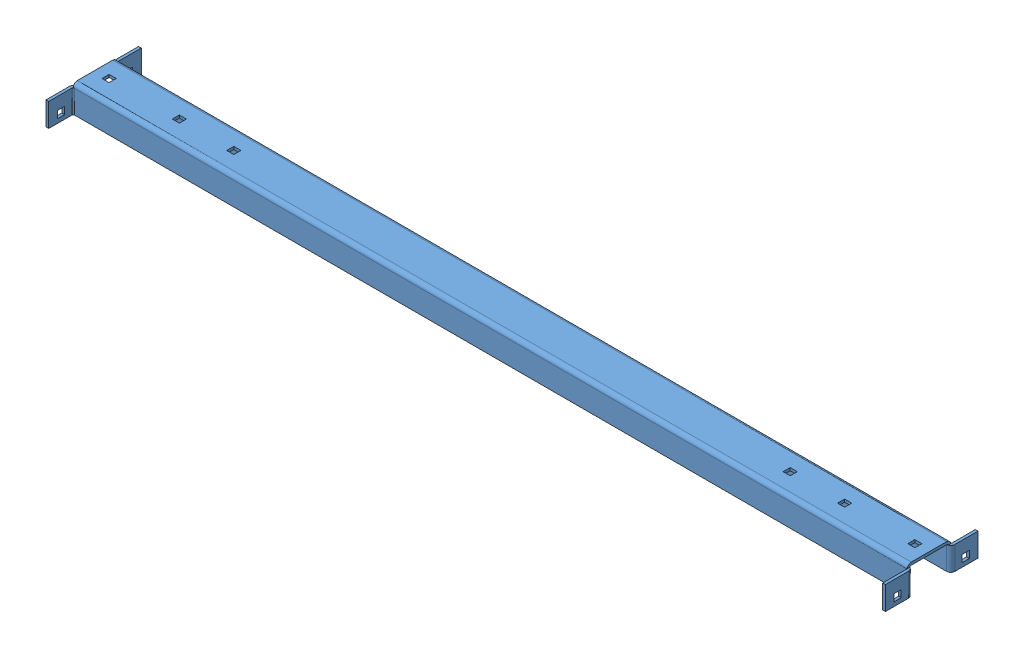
SolidWorks assembly ROULEAU DE GUIDAGE SUPERIEUR 0 DEGRE.SLDASM, configuration Défaut (file format 3800). Lengths in mm.
Overall size (1562 176.16 170).
4 component instances, 3 part files, 8 mates.
Components (placement in the parent):
- Traverse 1-1: Traverse 1.SLDPRT [Défaut] at (-64.6944 -77.8778 -526) size (1542 50 170)
- Support lateral pour rouleau-1: Support lateral pour rouleau.SLDPRT [Défaut] at (716.3056 -66.8778 -526) x (-1 0 0) z (0 0 -1) size (66.35 118.32 80)
- Rouleau superieur central plat-1: Rouleau superieur central plat.SLDPRT [Défaut] at (-777.1944 13.6222 -486) x (0 0.445108 -0.895477) z (1 0 0) size (89 89 1451)
- Support lateral pour rouleau-2: Support lateral pour rouleau.SLDPRT [Défaut] at (-845.6944 -66.8778 -446) size (66.35 118.32 80)
Mates (geometry in assembly coordinates):
- Distance2: distance = 4 mm anti-aligned: plane of Traverse 1-1 through (-830.6944 -52.8778 -521) normal (0 1 0); plane of Support lateral pour rouleau-1 through (707.3056 -48.8778 -446) normal (0 -1 0)
- Coïncidente8: coincident aligned: plane of Traverse 1-1 through (-830.6944 -102.8778 -446) normal (0 0 1); plane of Support lateral pour rouleau-1 through (707.3056 -51.8778 -446) normal (0 0 1)
- Distance3: distance = 4 mm anti-aligned: plane of Traverse 1-1 through (-830.6944 -52.8778 -521) normal (0 1 0); plane of Support lateral pour rouleau-2 through (-836.6944 -48.8778 -526) normal (0 -1 0)
- Coïncidente11: coincident aligned: plane of Traverse 1-1 through (-830.6944 -102.8778 -446) normal (0 0 1); plane of Support lateral pour rouleau-2 through (-836.6944 -51.8778 -446) normal (0 0 1)
- Coïncidente12: coincident aligned: plane of Traverse 1-1 through (668.8056 -57.8778 -492.5) normal (1 0 0); plane of Support lateral pour rouleau-1 through (668.8056 -52.8778 -466) normal (1 0 0)
- Coïncidente13: coincident aligned: plane of Traverse 1-1 through (-798.1944 -57.8778 -492.5) normal (-1 0 0); plane of Support lateral pour rouleau-2 through (-798.1944 -52.8778 -506) normal (-1 0 0)
- Coaxiale1: concentric anti-aligned: cylinder of Rouleau superieur central plat-1; cylinder of Support lateral pour rouleau-2
- Distance1: distance = 2.5 mm: plane of Rouleau superieur central plat-1 through (-777.1944 13.6222 -486) normal (-1 0 0); line of Support lateral pour rouleau-2
